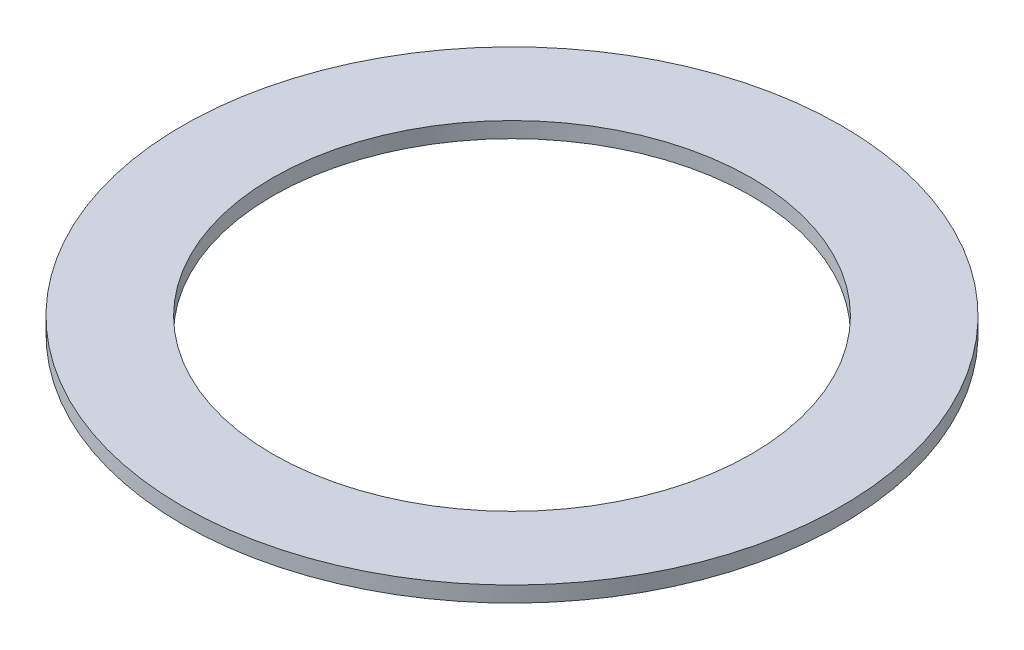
ISO-10303-21;
HEADER;
FILE_DESCRIPTION(('STEP AP214'),'2;1');
FILE_NAME('part.step','',(''),(''),'','','');
FILE_SCHEMA(('AUTOMOTIVE_DESIGN { 1 0 10303 214 1 1 1 1 }'));
ENDSEC;
DATA;
#1=APPLICATION_CONTEXT('core data for automotive mechanical design processes');
#2=APPLICATION_PROTOCOL_DEFINITION('international standard','automotive_design',2000,#1);
#3=PRODUCT_CONTEXT('',#1,'mechanical');
#4=PRODUCT('Part','Part','',(#3));
#5=PRODUCT_RELATED_PRODUCT_CATEGORY('part','',(#4));
#6=PRODUCT_DEFINITION_FORMATION('','',#4);
#7=PRODUCT_DEFINITION_CONTEXT('part definition',#1,'design');
#8=PRODUCT_DEFINITION('design','',#6,#7);
#9=PRODUCT_DEFINITION_SHAPE('','',#8);
#10=(LENGTH_UNIT() NAMED_UNIT(*) SI_UNIT(.MILLI.,.METRE.));
#11=(NAMED_UNIT(*) PLANE_ANGLE_UNIT() SI_UNIT($,.RADIAN.));
#12=(NAMED_UNIT(*) SI_UNIT($,.STERADIAN.) SOLID_ANGLE_UNIT());
#13=UNCERTAINTY_MEASURE_WITH_UNIT(LENGTH_MEASURE(1.E-05),#10,'distance_accuracy_value','');
#14=(GEOMETRIC_REPRESENTATION_CONTEXT(3) GLOBAL_UNCERTAINTY_ASSIGNED_CONTEXT((#13)) GLOBAL_UNIT_ASSIGNED_CONTEXT((#10,
#11,#12)) REPRESENTATION_CONTEXT('',''));
#15=CARTESIAN_POINT('',(0.,0.,0.));
#16=DIRECTION('',(0.,0.,1.));
#17=DIRECTION('',(1.,0.,0.));
#18=AXIS2_PLACEMENT_3D('',#15,#16,#17);
#19=CARTESIAN_POINT('',(0.,0.,0.));
#20=DIRECTION('',(0.,-1.,0.));
#21=DIRECTION('',(0.,0.,-1.));
#22=AXIS2_PLACEMENT_3D('',#19,#20,#21);
#23=CYLINDRICAL_SURFACE('',#22,15.25);
#24=CARTESIAN_POINT('',(0.,0.,0.));
#25=DIRECTION('',(0.,-1.,0.));
#26=DIRECTION('',(0.,0.,-1.));
#27=AXIS2_PLACEMENT_3D('',#24,#25,#26);
#28=CIRCLE('',#27,15.25);
#29=CARTESIAN_POINT('',(0.,0.,-15.25));
#30=VERTEX_POINT('',#29);
#31=EDGE_CURVE('E44',#30,#30,#28,.T.);
#32=ORIENTED_EDGE('',*,*,#31,.T.);
#33=EDGE_LOOP('',(#32));
#34=FACE_BOUND('',#33,.T.);
#35=CARTESIAN_POINT('',(0.,1.,0.));
#36=DIRECTION('',(0.,-1.,0.));
#37=DIRECTION('',(0.,0.,-1.));
#38=AXIS2_PLACEMENT_3D('',#35,#36,#37);
#39=CIRCLE('',#38,15.25);
#40=CARTESIAN_POINT('',(0.,1.,-15.25));
#41=VERTEX_POINT('',#40);
#42=EDGE_CURVE('E10',#41,#41,#39,.T.);
#43=ORIENTED_EDGE('',*,*,#42,.F.);
#44=EDGE_LOOP('',(#43));
#45=FACE_BOUND('',#44,.T.);
#46=ADVANCED_FACE('F30',(#34,#45),#23,.F.);
#47=CARTESIAN_POINT('',(15.25,1.,0.));
#48=DIRECTION('',(0.,1.,0.));
#49=DIRECTION('',(0.,0.,1.));
#50=AXIS2_PLACEMENT_3D('',#47,#48,#49);
#51=PLANE('',#50);
#52=ORIENTED_EDGE('',*,*,#42,.T.);
#53=EDGE_LOOP('',(#52));
#54=FACE_BOUND('',#53,.T.);
#55=CARTESIAN_POINT('',(0.,1.,0.));
#56=DIRECTION('',(0.,-1.,0.));
#57=DIRECTION('',(0.,0.,-1.));
#58=AXIS2_PLACEMENT_3D('',#55,#56,#57);
#59=CIRCLE('',#58,21.);
#60=CARTESIAN_POINT('',(0.,1.,-21.));
#61=VERTEX_POINT('',#60);
#62=EDGE_CURVE('E36',#61,#61,#59,.T.);
#63=ORIENTED_EDGE('',*,*,#62,.F.);
#64=EDGE_LOOP('',(#63));
#65=FACE_BOUND('',#64,.T.);
#66=ADVANCED_FACE('F60',(#54,#65),#51,.T.);
#67=CARTESIAN_POINT('',(0.,0.,0.));
#68=DIRECTION('',(0.,-1.,0.));
#69=DIRECTION('',(0.,0.,-1.));
#70=AXIS2_PLACEMENT_3D('',#67,#68,#69);
#71=CYLINDRICAL_SURFACE('',#70,21.);
#72=ORIENTED_EDGE('',*,*,#62,.T.);
#73=EDGE_LOOP('',(#72));
#74=FACE_BOUND('',#73,.T.);
#75=CARTESIAN_POINT('',(0.,0.,0.));
#76=DIRECTION('',(0.,-1.,0.));
#77=DIRECTION('',(0.,0.,-1.));
#78=AXIS2_PLACEMENT_3D('',#75,#76,#77);
#79=CIRCLE('',#78,21.);
#80=CARTESIAN_POINT('',(0.,0.,-21.));
#81=VERTEX_POINT('',#80);
#82=EDGE_CURVE('E40',#81,#81,#79,.T.);
#83=ORIENTED_EDGE('',*,*,#82,.F.);
#84=EDGE_LOOP('',(#83));
#85=FACE_BOUND('',#84,.T.);
#86=ADVANCED_FACE('F54',(#74,#85),#71,.T.);
#87=CARTESIAN_POINT('',(15.25,0.,0.));
#88=DIRECTION('',(0.,-1.,0.));
#89=DIRECTION('',(0.,0.,-1.));
#90=AXIS2_PLACEMENT_3D('',#87,#88,#89);
#91=PLANE('',#90);
#92=ORIENTED_EDGE('',*,*,#82,.T.);
#93=EDGE_LOOP('',(#92));
#94=FACE_BOUND('',#93,.T.);
#95=ORIENTED_EDGE('',*,*,#31,.F.);
#96=EDGE_LOOP('',(#95));
#97=FACE_BOUND('',#96,.T.);
#98=ADVANCED_FACE('F52',(#94,#97),#91,.T.);
#99=CLOSED_SHELL('',(#46,#66,#86,#98));
#100=MANIFOLD_SOLID_BREP('B2',#99);
#101=ADVANCED_BREP_SHAPE_REPRESENTATION('',(#18,#100),#14);
#102=SHAPE_DEFINITION_REPRESENTATION(#9,#101);
ENDSEC;
END-ISO-10303-21;
